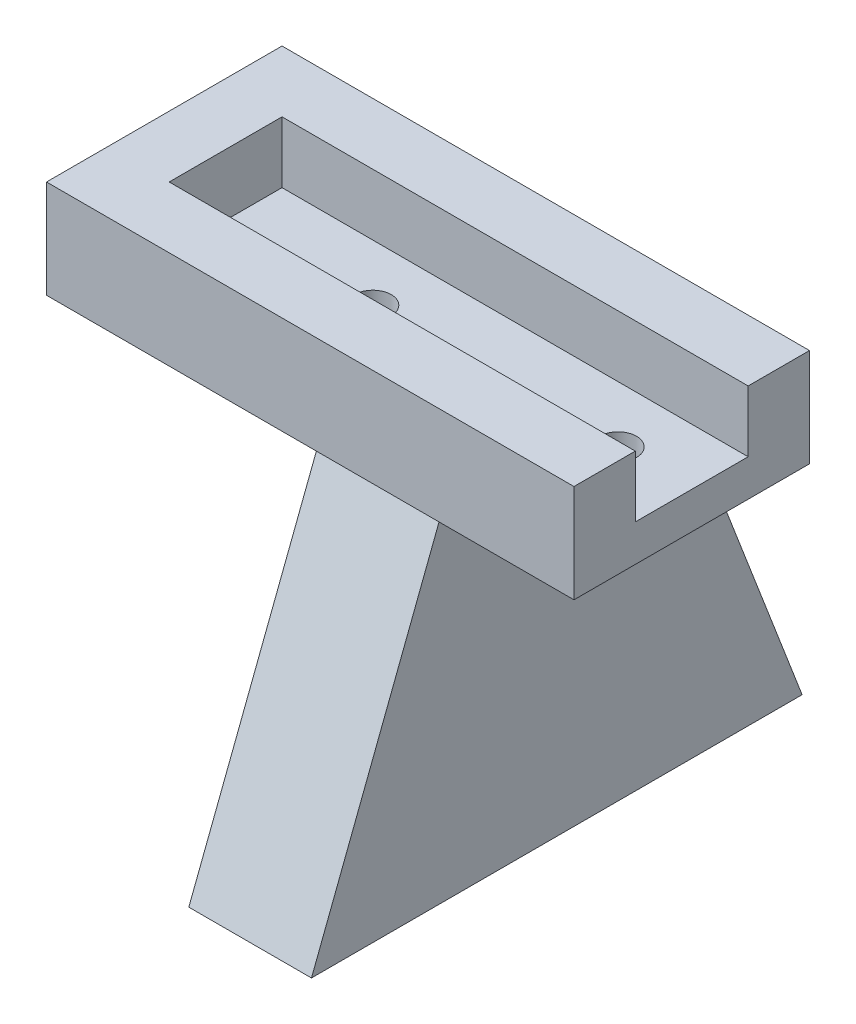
from build123d import *

# Parameters (mm, degrees)
BOSS_EXTRUDE1_DEPTH      = 26
BOSS_EXTRUDE1_DEPTH_BACK = 12
CUT_EXTRUDE1_DEPTH       = 29.163096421
CUT_EXTRUDE1_DEPTH_BACK  = 29.163096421
SKETCH4_R                = 1.5
BOSS_EXTRUDE2_DEPTH      = 5
SKETCH7_W                = 19.2
SKETCH7_H                = 8
BOSS_EXTRUDE3_DEPTH      = 5


with BuildPart() as part:
    # Sketch3 → Boss-Extrude1 (new, two sides: drawn at the far end of the back side and taken through both)
    with BuildSketch(Plane(origin=(0, 0, 0), x_dir=(0, 0, -1), z_dir=(1, 0, 0)).offset(-BOSS_EXTRUDE1_DEPTH_BACK)):
        Polygon((-4.6, 0), (-4.6, 5), (-9.6, 5), (-9.6, -3), (9.6, -3), (9.6, 5), (4.6, 5), (4.6, 0), align=None)
    extrude(amount=BOSS_EXTRUDE1_DEPTH + BOSS_EXTRUDE1_DEPTH_BACK)

    # Sketch4 → Cut-Extrude1 (cut, two sides: drawn at the far end of the back side and taken through both)
    with BuildSketch(Plane(origin=(0, 0, 0), x_dir=(1, 0, 0), z_dir=(0, 1, 0)).offset(-CUT_EXTRUDE1_DEPTH_BACK)):
        with Locations(Location((0, 0, 0), (0, 0, 270))):
            Circle(SKETCH4_R)
        with Locations(Location((20, 0, 0), (0, 0, 270))):
            Circle(SKETCH4_R)
    extrude(amount=CUT_EXTRUDE1_DEPTH + CUT_EXTRUDE1_DEPTH_BACK, mode=Mode.SUBTRACT)

    # Sketch6 → Boss-Extrude2 (add, symmetric)
    with BuildSketch(Plane(origin=(10, 0, 0), x_dir=(0, 0, -1), z_dir=(1, 0, 0))):
        Polygon((-20, -30), (-9.6, -3), (9.6, -3), (20, -30), align=None)
    extrude(amount=BOSS_EXTRUDE2_DEPTH, both=True)

    # Sketch7 → Boss-Extrude3 (add)
    with BuildSketch(Plane.ZY.offset(12)):
        with Locations((0, 1)):
            Rectangle(SKETCH7_W, SKETCH7_H)
    extrude(amount=BOSS_EXTRUDE3_DEPTH)


solid = part.part
